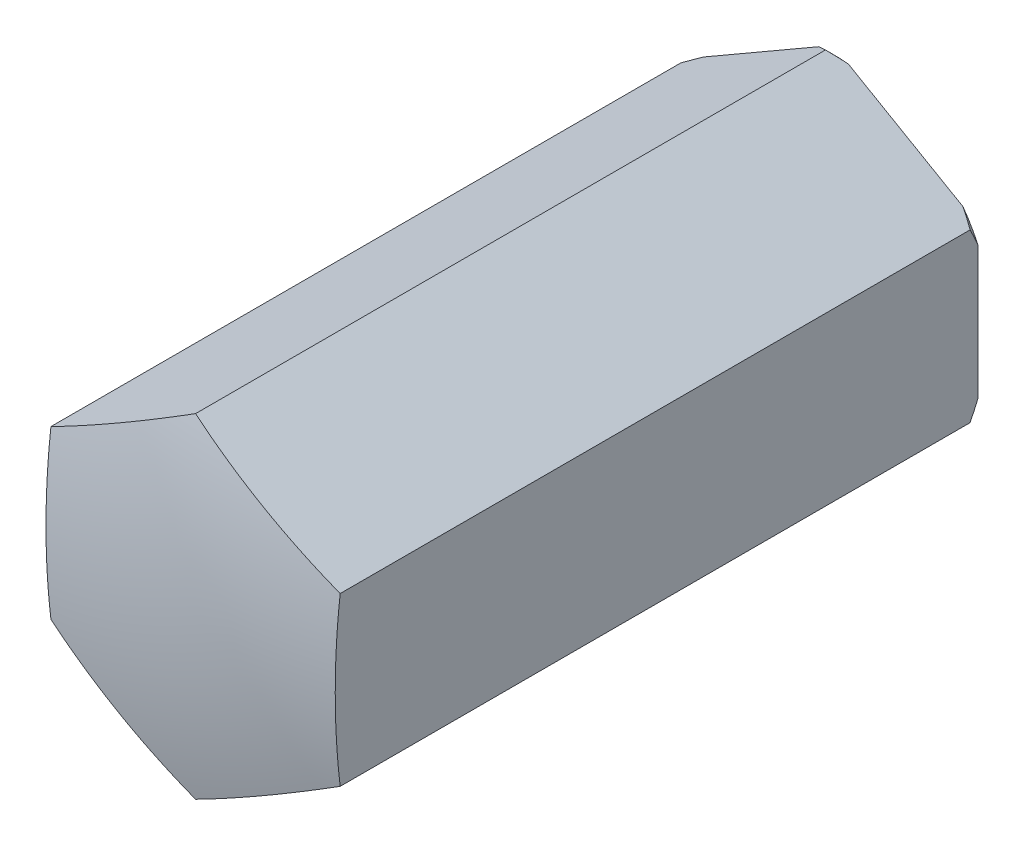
ISO-10303-21;
HEADER;
FILE_DESCRIPTION(('STEP AP214'),'2;1');
FILE_NAME('part.step','',(''),(''),'','','');
FILE_SCHEMA(('AUTOMOTIVE_DESIGN { 1 0 10303 214 1 1 1 1 }'));
ENDSEC;
DATA;
#1=APPLICATION_CONTEXT('core data for automotive mechanical design processes');
#2=APPLICATION_PROTOCOL_DEFINITION('international standard','automotive_design',2000,#1);
#3=PRODUCT_CONTEXT('',#1,'mechanical');
#4=PRODUCT('Part','Part','',(#3));
#5=PRODUCT_RELATED_PRODUCT_CATEGORY('part','',(#4));
#6=PRODUCT_DEFINITION_FORMATION('','',#4);
#7=PRODUCT_DEFINITION_CONTEXT('part definition',#1,'design');
#8=PRODUCT_DEFINITION('design','',#6,#7);
#9=PRODUCT_DEFINITION_SHAPE('','',#8);
#10=(LENGTH_UNIT() NAMED_UNIT(*) SI_UNIT(.MILLI.,.METRE.));
#11=(NAMED_UNIT(*) PLANE_ANGLE_UNIT() SI_UNIT($,.RADIAN.));
#12=(NAMED_UNIT(*) SI_UNIT($,.STERADIAN.) SOLID_ANGLE_UNIT());
#13=UNCERTAINTY_MEASURE_WITH_UNIT(LENGTH_MEASURE(1.E-05),#10,'distance_accuracy_value','');
#14=(GEOMETRIC_REPRESENTATION_CONTEXT(3) GLOBAL_UNCERTAINTY_ASSIGNED_CONTEXT((#13)) GLOBAL_UNIT_ASSIGNED_CONTEXT((#10,
#11,#12)) REPRESENTATION_CONTEXT('',''));
#15=CARTESIAN_POINT('',(0.,0.,0.));
#16=DIRECTION('',(0.,0.,1.));
#17=DIRECTION('',(1.,0.,0.));
#18=AXIS2_PLACEMENT_3D('',#15,#16,#17);
#19=CARTESIAN_POINT('',(0.,0.,0.));
#20=DIRECTION('',(0.,0.,1.));
#21=DIRECTION('',(0.,-1.,0.));
#22=AXIS2_PLACEMENT_3D('',#19,#20,#21);
#23=CONICAL_SURFACE('',#22,12.1,0.785398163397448);
#24=CARTESIAN_POINT('',(-9.86507388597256,7.00610285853,-0.00019999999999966));
#25=CARTESIAN_POINT('',(-9.96119990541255,6.95060447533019,0.0460383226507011));
#26=CARTESIAN_POINT('',(-10.0569364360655,6.89533096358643,0.0933496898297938));
#27=CARTESIAN_POINT('',(-10.2476169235,6.78524153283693,0.189970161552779));
#28=CARTESIAN_POINT('',(-10.3425611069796,6.73042548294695,0.239278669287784));
#29=CARTESIAN_POINT('',(-10.5316981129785,6.62122718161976,0.339771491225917));
#30=CARTESIAN_POINT('',(-10.6258909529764,6.56684492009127,0.390955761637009));
#31=CARTESIAN_POINT('',(-10.8135745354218,6.4584857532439,0.495094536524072));
#32=CARTESIAN_POINT('',(-10.9070650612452,6.40450897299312,0.548049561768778));
#33=CARTESIAN_POINT('',(-11.0002,6.35073749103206,0.601821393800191));
#34=B_SPLINE_CURVE_WITH_KNOTS('',3,(#24,#25,#26,#27,#28,#29,#30,#31,#32,#33),.UNSPECIFIED.,.F.,
.F.,(4,2,2,2,4),(0.,0.360718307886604,0.721329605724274,1.08193248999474,1.4426423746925),.UNSPECIFIED.);
#35=CARTESIAN_POINT('',(-9.86548966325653,7.00586280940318,0.));
#36=VERTEX_POINT('',#35);
#37=CARTESIAN_POINT('',(-11.,6.3508529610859,0.601705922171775));
#38=VERTEX_POINT('',#37);
#39=EDGE_CURVE('E223',#36,#38,#34,.T.);
#40=ORIENTED_EDGE('',*,*,#39,.F.);
#41=CARTESIAN_POINT('',(0.,0.,0.));
#42=DIRECTION('',(0.,0.,-1.));
#43=DIRECTION('',(0.,1.,0.));
#44=AXIS2_PLACEMENT_3D('',#41,#42,#43);
#45=CIRCLE('',#44,12.1);
#46=CARTESIAN_POINT('',(-11.,5.04083326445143,0.));
#47=VERTEX_POINT('',#46);
#48=EDGE_CURVE('E232',#47,#36,#45,.T.);
#49=ORIENTED_EDGE('',*,*,#48,.F.);
#50=CARTESIAN_POINT('',(-11.,16.0724477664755,7.37623108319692));
#51=CARTESIAN_POINT('',(-11.,15.8702057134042,7.2093371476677));
#52=CARTESIAN_POINT('',(-11.,15.6674737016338,7.04303709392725));
#53=CARTESIAN_POINT('',(-11.,15.2609313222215,6.71175492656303));
#54=CARTESIAN_POINT('',(-11.,15.0571209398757,6.54677283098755));
#55=CARTESIAN_POINT('',(-11.,14.4438351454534,6.05392702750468));
#56=CARTESIAN_POINT('',(-11.,14.0326017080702,5.72824373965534));
#57=CARTESIAN_POINT('',(-11.,13.1999564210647,5.08050106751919));
#58=CARTESIAN_POINT('',(-11.,12.7784823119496,4.75852150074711));
#59=CARTESIAN_POINT('',(-11.,11.9286566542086,4.12384110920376));
#60=CARTESIAN_POINT('',(-11.,11.5003057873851,3.81113937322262));
#61=CARTESIAN_POINT('',(-11.,10.5931500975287,3.16769731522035));
#62=CARTESIAN_POINT('',(-11.,10.1134868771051,2.83815635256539));
#63=CARTESIAN_POINT('',(-11.,9.38449294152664,2.35805816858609));
#64=CARTESIAN_POINT('',(-11.,9.13985858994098,2.20036220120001));
#65=CARTESIAN_POINT('',(-11.,8.64708986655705,1.89054685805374));
#66=CARTESIAN_POINT('',(-11.,8.39895566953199,1.73842720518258));
#67=CARTESIAN_POINT('',(-11.,7.89995903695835,1.441394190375));
#68=CARTESIAN_POINT('',(-11.,7.64911460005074,1.29645066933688));
#69=CARTESIAN_POINT('',(-11.,7.14316420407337,1.01414178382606));
#70=CARTESIAN_POINT('',(-11.,6.8880580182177,0.876776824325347));
#71=CARTESIAN_POINT('',(-11.,6.37340355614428,0.611087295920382));
#72=CARTESIAN_POINT('',(-11.,6.11385871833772,0.482756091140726));
#73=CARTESIAN_POINT('',(-11.,5.58983912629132,0.236644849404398));
#74=CARTESIAN_POINT('',(-11.,5.32536528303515,0.118862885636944));
#75=CARTESIAN_POINT('',(-11.,4.87055760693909,-0.0711489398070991));
#76=CARTESIAN_POINT('',(-11.,4.68153595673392,-0.146517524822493));
#77=CARTESIAN_POINT('',(-11.,4.30090682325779,-0.290396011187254));
#78=CARTESIAN_POINT('',(-11.,4.10929935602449,-0.35890595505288));
#79=CARTESIAN_POINT('',(-11.,3.53054922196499,-0.55302199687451));
#80=CARTESIAN_POINT('',(-11.,3.13947003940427,-0.667218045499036));
#81=CARTESIAN_POINT('',(-11.,2.3571577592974,-0.856520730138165));
#82=CARTESIAN_POINT('',(-11.,1.96613010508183,-0.932456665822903));
#83=CARTESIAN_POINT('',(-11.,1.3754168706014,-1.01606525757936));
#84=CARTESIAN_POINT('',(-11.,1.17780635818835,-1.03888598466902));
#85=CARTESIAN_POINT('',(-11.,0.781637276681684,-1.0740268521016));
#86=CARTESIAN_POINT('',(-11.,0.583078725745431,-1.0863471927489));
#87=CARTESIAN_POINT('',(-11.,0.196510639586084,-1.09984708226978));
#88=CARTESIAN_POINT('',(-11.,0.00852086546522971,-1.10160151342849));
#89=CARTESIAN_POINT('',(-11.,-0.367323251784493,-1.09547279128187));
#90=CARTESIAN_POINT('',(-11.,-0.555177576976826,-1.08758853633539));
#91=CARTESIAN_POINT('',(-11.,-0.930229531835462,-1.06232225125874));
#92=CARTESIAN_POINT('',(-11.,-1.11742721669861,-1.04494103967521));
#93=CARTESIAN_POINT('',(-11.,-1.49075054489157,-1.00099406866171));
#94=CARTESIAN_POINT('',(-11.,-1.67687603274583,-0.974427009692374));
#95=CARTESIAN_POINT('',(-11.,-2.24018324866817,-0.880381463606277));
#96=CARTESIAN_POINT('',(-11.,-2.61511811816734,-0.799063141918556));
#97=CARTESIAN_POINT('',(-11.,-3.35650285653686,-0.604878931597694));
#98=CARTESIAN_POINT('',(-11.,-3.72295280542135,-0.492013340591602));
#99=CARTESIAN_POINT('',(-11.,-4.4529629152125,-0.237887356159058));
#100=CARTESIAN_POINT('',(-11.,-4.81636046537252,-0.0961649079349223));
#101=CARTESIAN_POINT('',(-11.,-5.53386860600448,0.20927334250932));
#102=CARTESIAN_POINT('',(-11.,-5.88797506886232,0.372998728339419));
#103=CARTESIAN_POINT('',(-11.,-6.5885282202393,0.718563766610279));
#104=CARTESIAN_POINT('',(-11.,-6.93494780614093,0.900457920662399));
#105=CARTESIAN_POINT('',(-11.,-7.61987412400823,1.27837528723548));
#106=CARTESIAN_POINT('',(-11.,-7.95838202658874,1.47439639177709));
#107=CARTESIAN_POINT('',(-11.,-8.61194162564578,1.86785203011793));
#108=CARTESIAN_POINT('',(-11.,-8.92732558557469,2.06473756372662));
#109=CARTESIAN_POINT('',(-11.,-9.55267412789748,2.46695903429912));
#110=CARTESIAN_POINT('',(-11.,-9.86263830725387,2.67229559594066));
#111=CARTESIAN_POINT('',(-11.,-10.4753887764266,3.08826754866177));
#112=CARTESIAN_POINT('',(-11.,-10.7782124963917,3.29884800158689));
#113=CARTESIAN_POINT('',(-11.,-11.3796956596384,3.72570793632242));
#114=CARTESIAN_POINT('',(-11.,-11.6783562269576,3.94198583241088));
#115=CARTESIAN_POINT('',(-11.,-11.9752680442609,4.16059792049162));
#116=B_SPLINE_CURVE_WITH_KNOTS('',3,(#50,#51,#52,#53,#54,#55,#56,#57,#58,#59,#60,#61,#62,#63,
#64,#65,#66,#67,#68,#69,#70,#71,#72,#73,#74,#75,#76,#77,#78,#79,#80,#81,#82,#83,#84,#85,#86,#87,
#88,#89,#90,#91,#92,#93,#94,#95,#96,#97,#98,#99,#100,#101,#102,#103,#104,#105,#106,#107,#108,
#109,#110,#111,#112,#113,#114,#115),.UNSPECIFIED.,.F.,.F.,(4,2,2,2,2,2,2,2,2,2,2,2,2,2,2,2,2,2,
2,2,2,2,2,2,2,2,2,2,2,2,2,2,4),(0.,0.7866358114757,1.57328237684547,3.14695168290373,
4.73801099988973,6.32891353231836,8.0743905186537,8.94750152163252,9.82056907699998,
10.6895860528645,11.5586494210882,12.4270675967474,13.2953268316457,13.9056838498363,
14.5160370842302,15.7367149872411,16.9296541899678,17.5261883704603,18.1227111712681,
18.6864613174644,19.2502759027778,19.8140419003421,20.3778876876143,21.5270730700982,
22.6762476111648,23.845519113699,25.0153015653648,26.1887049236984,27.3619335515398,
28.4771587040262,29.5924664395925,30.698929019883,31.8050868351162),.UNSPECIFIED.);
#117=EDGE_CURVE('E216',#38,#47,#116,.T.);
#118=ORIENTED_EDGE('',*,*,#117,.F.);
#119=EDGE_LOOP('',(#40,#49,#118));
#120=FACE_BOUND('',#119,.T.);
#121=ADVANCED_FACE('F14',(#120),#23,.T.);
#122=CARTESIAN_POINT('',(-11.,-5.04083326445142,0.));
#123=VERTEX_POINT('',#122);
#124=CARTESIAN_POINT('',(-11.,-6.3508529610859,0.601705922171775));
#125=VERTEX_POINT('',#124);
#126=EDGE_CURVE('E209',#123,#125,#116,.T.);
#127=ORIENTED_EDGE('',*,*,#126,.F.);
#128=CARTESIAN_POINT('',(-9.86548966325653,-7.00586280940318,0.));
#129=VERTEX_POINT('',#128);
#130=EDGE_CURVE('E255',#129,#123,#45,.T.);
#131=ORIENTED_EDGE('',*,*,#130,.F.);
#132=CARTESIAN_POINT('',(-11.0002,-6.35073749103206,0.601821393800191));
#133=CARTESIAN_POINT('',(-10.9070650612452,-6.40450897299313,0.548049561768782));
#134=CARTESIAN_POINT('',(-10.8135745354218,-6.4584857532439,0.495094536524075));
#135=CARTESIAN_POINT('',(-10.6258909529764,-6.56684492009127,0.390955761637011));
#136=CARTESIAN_POINT('',(-10.5316981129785,-6.62122718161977,0.339771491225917));
#137=CARTESIAN_POINT('',(-10.3425611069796,-6.73042548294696,0.239278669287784));
#138=CARTESIAN_POINT('',(-10.2476169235,-6.78524153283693,0.189970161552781));
#139=CARTESIAN_POINT('',(-10.0569364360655,-6.89533096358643,0.0933496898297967));
#140=CARTESIAN_POINT('',(-9.96119990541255,-6.95060447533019,0.0460383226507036));
#141=CARTESIAN_POINT('',(-9.86507388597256,-7.00610285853,-0.000200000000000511));
#142=B_SPLINE_CURVE_WITH_KNOTS('',3,(#132,#133,#134,#135,#136,#137,#138,#139,#140,#141),
.UNSPECIFIED.,.F.,.F.,(4,2,2,2,4),(0.,0.360709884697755,0.721312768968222,1.08192406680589,
1.4426423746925),.UNSPECIFIED.);
#143=EDGE_CURVE('E185',#125,#129,#142,.T.);
#144=ORIENTED_EDGE('',*,*,#143,.F.);
#145=EDGE_LOOP('',(#127,#131,#144));
#146=FACE_BOUND('',#145,.T.);
#147=ADVANCED_FACE('F287',(#146),#23,.T.);
#148=CARTESIAN_POINT('',(-1.13492611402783,-12.0464560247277,-0.00019999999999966));
#149=CARTESIAN_POINT('',(-1.0388000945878,-12.1019544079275,0.0460383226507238));
#150=CARTESIAN_POINT('',(-0.94306356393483,-12.1572279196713,0.0933496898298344));
#151=CARTESIAN_POINT('',(-0.752383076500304,-12.2673173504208,0.189970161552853));
#152=CARTESIAN_POINT('',(-0.657438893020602,-12.3221334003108,0.239278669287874));
#153=CARTESIAN_POINT('',(-0.468301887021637,-12.431331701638,0.339771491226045));
#154=CARTESIAN_POINT('',(-0.374109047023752,-12.4857139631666,0.390955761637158));
#155=CARTESIAN_POINT('',(-0.186425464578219,-12.594073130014,0.495094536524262));
#156=CARTESIAN_POINT('',(-0.0929349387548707,-12.6480499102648,0.548049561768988));
#157=CARTESIAN_POINT('',(0.000199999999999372,-12.7018213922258,0.601821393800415));
#158=B_SPLINE_CURVE_WITH_KNOTS('',3,(#148,#149,#150,#151,#152,#153,#154,#155,#156,#157),
.UNSPECIFIED.,.F.,.F.,(4,2,2,2,4),(0.,0.360718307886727,0.721329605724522,1.08193248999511,
1.44264237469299),.UNSPECIFIED.);
#159=CARTESIAN_POINT('',(-1.13451033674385,-12.0466960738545,0.));
#160=VERTEX_POINT('',#159);
#161=CARTESIAN_POINT('',(0.,-12.701705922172,0.601705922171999));
#162=VERTEX_POINT('',#161);
#163=EDGE_CURVE('E191',#160,#162,#158,.T.);
#164=ORIENTED_EDGE('',*,*,#163,.F.);
#165=CARTESIAN_POINT('',(1.13451033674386,-12.0466960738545,0.));
#166=VERTEX_POINT('',#165);
#167=EDGE_CURVE('E256',#166,#160,#45,.T.);
#168=ORIENTED_EDGE('',*,*,#167,.F.);
#169=CARTESIAN_POINT('',(-0.000200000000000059,-12.7018213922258,0.601821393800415));
#170=CARTESIAN_POINT('',(0.0929349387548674,-12.6480499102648,0.548049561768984));
#171=CARTESIAN_POINT('',(0.186425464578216,-12.594073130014,0.495094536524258));
#172=CARTESIAN_POINT('',(0.374109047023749,-12.4857139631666,0.390955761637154));
#173=CARTESIAN_POINT('',(0.468301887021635,-12.431331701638,0.339771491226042));
#174=CARTESIAN_POINT('',(0.6574388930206,-12.3221334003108,0.239278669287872));
#175=CARTESIAN_POINT('',(0.752383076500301,-12.2673173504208,0.189970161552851));
#176=CARTESIAN_POINT('',(0.943063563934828,-12.1572279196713,0.0933496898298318));
#177=CARTESIAN_POINT('',(1.0388000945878,-12.1019544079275,0.0460383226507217));
#178=CARTESIAN_POINT('',(1.13492611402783,-12.0464560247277,-0.000199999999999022));
#179=B_SPLINE_CURVE_WITH_KNOTS('',3,(#169,#170,#171,#172,#173,#174,#175,#176,#177,#178),
.UNSPECIFIED.,.F.,.F.,(4,2,2,2,4),(0.,0.360709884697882,0.721312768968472,1.08192406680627,
1.44264237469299),.UNSPECIFIED.);
#180=EDGE_CURVE('E172',#162,#166,#179,.T.);
#181=ORIENTED_EDGE('',*,*,#180,.F.);
#182=EDGE_LOOP('',(#164,#168,#181));
#183=FACE_BOUND('',#182,.T.);
#184=ADVANCED_FACE('F280',(#183),#23,.T.);
#185=CARTESIAN_POINT('',(9.86507388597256,-7.00610285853,-0.00019999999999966));
#186=CARTESIAN_POINT('',(9.96119990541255,-6.95060447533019,0.0460383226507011));
#187=CARTESIAN_POINT('',(10.0569364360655,-6.89533096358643,0.0933496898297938));
#188=CARTESIAN_POINT('',(10.2476169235,-6.78524153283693,0.189970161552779));
#189=CARTESIAN_POINT('',(10.3425611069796,-6.73042548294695,0.239278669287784));
#190=CARTESIAN_POINT('',(10.5316981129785,-6.62122718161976,0.339771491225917));
#191=CARTESIAN_POINT('',(10.6258909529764,-6.56684492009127,0.390955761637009));
#192=CARTESIAN_POINT('',(10.8135745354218,-6.4584857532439,0.495094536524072));
#193=CARTESIAN_POINT('',(10.9070650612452,-6.40450897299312,0.548049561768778));
#194=CARTESIAN_POINT('',(11.0002,-6.35073749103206,0.601821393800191));
#195=B_SPLINE_CURVE_WITH_KNOTS('',3,(#185,#186,#187,#188,#189,#190,#191,#192,#193,#194),
.UNSPECIFIED.,.F.,.F.,(4,2,2,2,4),(0.,0.360718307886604,0.721329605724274,1.08193248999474,
1.4426423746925),.UNSPECIFIED.);
#196=CARTESIAN_POINT('',(9.86548966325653,-7.00586280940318,0.));
#197=VERTEX_POINT('',#196);
#198=CARTESIAN_POINT('',(11.,-6.3508529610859,0.601705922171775));
#199=VERTEX_POINT('',#198);
#200=EDGE_CURVE('E178',#197,#199,#195,.T.);
#201=ORIENTED_EDGE('',*,*,#200,.F.);
#202=CARTESIAN_POINT('',(11.,-5.04083326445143,0.));
#203=VERTEX_POINT('',#202);
#204=EDGE_CURVE('E260',#203,#197,#45,.T.);
#205=ORIENTED_EDGE('',*,*,#204,.F.);
#206=CARTESIAN_POINT('',(11.,16.0724477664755,7.37623108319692));
#207=CARTESIAN_POINT('',(11.,15.8702057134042,7.2093371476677));
#208=CARTESIAN_POINT('',(11.,15.6674737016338,7.04303709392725));
#209=CARTESIAN_POINT('',(11.,15.2609313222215,6.71175492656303));
#210=CARTESIAN_POINT('',(11.,15.0571209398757,6.54677283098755));
#211=CARTESIAN_POINT('',(11.,14.4438351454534,6.05392702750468));
#212=CARTESIAN_POINT('',(11.,14.0326017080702,5.72824373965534));
#213=CARTESIAN_POINT('',(11.,13.1999564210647,5.08050106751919));
#214=CARTESIAN_POINT('',(11.,12.7784823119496,4.75852150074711));
#215=CARTESIAN_POINT('',(11.,11.9286566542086,4.12384110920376));
#216=CARTESIAN_POINT('',(11.,11.5003057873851,3.81113937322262));
#217=CARTESIAN_POINT('',(11.,10.5931500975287,3.16769731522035));
#218=CARTESIAN_POINT('',(11.,10.1134868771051,2.83815635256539));
#219=CARTESIAN_POINT('',(11.,9.38449294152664,2.35805816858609));
#220=CARTESIAN_POINT('',(11.,9.13985858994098,2.20036220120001));
#221=CARTESIAN_POINT('',(11.,8.64708986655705,1.89054685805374));
#222=CARTESIAN_POINT('',(11.,8.39895566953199,1.73842720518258));
#223=CARTESIAN_POINT('',(11.,7.89995903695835,1.441394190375));
#224=CARTESIAN_POINT('',(11.,7.64911460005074,1.29645066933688));
#225=CARTESIAN_POINT('',(11.,7.14316420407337,1.01414178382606));
#226=CARTESIAN_POINT('',(11.,6.8880580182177,0.876776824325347));
#227=CARTESIAN_POINT('',(11.,6.37340355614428,0.611087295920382));
#228=CARTESIAN_POINT('',(11.,6.11385871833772,0.482756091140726));
#229=CARTESIAN_POINT('',(11.,5.58983912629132,0.236644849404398));
#230=CARTESIAN_POINT('',(11.,5.32536528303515,0.118862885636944));
#231=CARTESIAN_POINT('',(11.,4.87055760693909,-0.0711489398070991));
#232=CARTESIAN_POINT('',(11.,4.68153595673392,-0.146517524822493));
#233=CARTESIAN_POINT('',(11.,4.30090682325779,-0.290396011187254));
#234=CARTESIAN_POINT('',(11.,4.10929935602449,-0.35890595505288));
#235=CARTESIAN_POINT('',(11.,3.53054922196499,-0.55302199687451));
#236=CARTESIAN_POINT('',(11.,3.13947003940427,-0.667218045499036));
#237=CARTESIAN_POINT('',(11.,2.3571577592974,-0.856520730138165));
#238=CARTESIAN_POINT('',(11.,1.96613010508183,-0.932456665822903));
#239=CARTESIAN_POINT('',(11.,1.3754168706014,-1.01606525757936));
#240=CARTESIAN_POINT('',(11.,1.17780635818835,-1.03888598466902));
#241=CARTESIAN_POINT('',(11.,0.781637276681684,-1.0740268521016));
#242=CARTESIAN_POINT('',(11.,0.583078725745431,-1.0863471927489));
#243=CARTESIAN_POINT('',(11.,0.196510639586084,-1.09984708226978));
#244=CARTESIAN_POINT('',(11.,0.00852086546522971,-1.10160151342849));
#245=CARTESIAN_POINT('',(11.,-0.367323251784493,-1.09547279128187));
#246=CARTESIAN_POINT('',(11.,-0.555177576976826,-1.08758853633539));
#247=CARTESIAN_POINT('',(11.,-0.930229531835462,-1.06232225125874));
#248=CARTESIAN_POINT('',(11.,-1.11742721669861,-1.04494103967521));
#249=CARTESIAN_POINT('',(11.,-1.49075054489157,-1.00099406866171));
#250=CARTESIAN_POINT('',(11.,-1.67687603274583,-0.974427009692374));
#251=CARTESIAN_POINT('',(11.,-2.24018324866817,-0.880381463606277));
#252=CARTESIAN_POINT('',(11.,-2.61511811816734,-0.799063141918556));
#253=CARTESIAN_POINT('',(11.,-3.35650285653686,-0.604878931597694));
#254=CARTESIAN_POINT('',(11.,-3.72295280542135,-0.492013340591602));
#255=CARTESIAN_POINT('',(11.,-4.4529629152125,-0.237887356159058));
#256=CARTESIAN_POINT('',(11.,-4.81636046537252,-0.0961649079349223));
#257=CARTESIAN_POINT('',(11.,-5.53386860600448,0.20927334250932));
#258=CARTESIAN_POINT('',(11.,-5.88797506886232,0.372998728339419));
#259=CARTESIAN_POINT('',(11.,-6.5885282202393,0.718563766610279));
#260=CARTESIAN_POINT('',(11.,-6.93494780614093,0.900457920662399));
#261=CARTESIAN_POINT('',(11.,-7.61987412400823,1.27837528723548));
#262=CARTESIAN_POINT('',(11.,-7.95838202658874,1.47439639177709));
#263=CARTESIAN_POINT('',(11.,-8.61194162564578,1.86785203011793));
#264=CARTESIAN_POINT('',(11.,-8.92732558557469,2.06473756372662));
#265=CARTESIAN_POINT('',(11.,-9.55267412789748,2.46695903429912));
#266=CARTESIAN_POINT('',(11.,-9.86263830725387,2.67229559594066));
#267=CARTESIAN_POINT('',(11.,-10.4753887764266,3.08826754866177));
#268=CARTESIAN_POINT('',(11.,-10.7782124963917,3.29884800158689));
#269=CARTESIAN_POINT('',(11.,-11.3796956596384,3.72570793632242));
#270=CARTESIAN_POINT('',(11.,-11.6783562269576,3.94198583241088));
#271=CARTESIAN_POINT('',(11.,-11.9752680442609,4.16059792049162));
#272=B_SPLINE_CURVE_WITH_KNOTS('',3,(#206,#207,#208,#209,#210,#211,#212,#213,#214,#215,#216,
#217,#218,#219,#220,#221,#222,#223,#224,#225,#226,#227,#228,#229,#230,#231,#232,#233,#234,#235,
#236,#237,#238,#239,#240,#241,#242,#243,#244,#245,#246,#247,#248,#249,#250,#251,#252,#253,#254,
#255,#256,#257,#258,#259,#260,#261,#262,#263,#264,#265,#266,#267,#268,#269,#270,#271),
.UNSPECIFIED.,.F.,.F.,(4,2,2,2,2,2,2,2,2,2,2,2,2,2,2,2,2,2,2,2,2,2,2,2,2,2,2,2,2,2,2,2,4),(0.,
0.7866358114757,1.57328237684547,3.14695168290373,4.73801099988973,6.32891353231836,
8.0743905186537,8.94750152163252,9.82056907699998,10.6895860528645,11.5586494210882,
12.4270675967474,13.2953268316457,13.9056838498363,14.5160370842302,15.7367149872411,
16.9296541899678,17.5261883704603,18.1227111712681,18.6864613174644,19.2502759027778,
19.8140419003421,20.3778876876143,21.5270730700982,22.6762476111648,23.845519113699,
25.0153015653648,26.1887049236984,27.3619335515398,28.4771587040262,29.5924664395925,
30.698929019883,31.8050868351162),.UNSPECIFIED.);
#273=EDGE_CURVE('E171',#199,#203,#272,.F.);
#274=ORIENTED_EDGE('',*,*,#273,.F.);
#275=EDGE_LOOP('',(#201,#205,#274));
#276=FACE_BOUND('',#275,.T.);
#277=ADVANCED_FACE('F274',(#276),#23,.T.);
#278=CARTESIAN_POINT('',(0.000200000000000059,12.7018213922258,0.601821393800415));
#279=CARTESIAN_POINT('',(-0.0929349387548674,12.6480499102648,0.548049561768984));
#280=CARTESIAN_POINT('',(-0.186425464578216,12.594073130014,0.495094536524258));
#281=CARTESIAN_POINT('',(-0.374109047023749,12.4857139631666,0.390955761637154));
#282=CARTESIAN_POINT('',(-0.468301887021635,12.431331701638,0.339771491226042));
#283=CARTESIAN_POINT('',(-0.6574388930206,12.3221334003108,0.239278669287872));
#284=CARTESIAN_POINT('',(-0.752383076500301,12.2673173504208,0.189970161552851));
#285=CARTESIAN_POINT('',(-0.943063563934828,12.1572279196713,0.0933496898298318));
#286=CARTESIAN_POINT('',(-1.0388000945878,12.1019544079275,0.0460383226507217));
#287=CARTESIAN_POINT('',(-1.13492611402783,12.0464560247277,-0.000199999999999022));
#288=B_SPLINE_CURVE_WITH_KNOTS('',3,(#278,#279,#280,#281,#282,#283,#284,#285,#286,#287),
.UNSPECIFIED.,.F.,.F.,(4,2,2,2,4),(0.,0.360709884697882,0.721312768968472,1.08192406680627,
1.44264237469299),.UNSPECIFIED.);
#289=CARTESIAN_POINT('',(0.,12.701705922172,0.601705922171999));
#290=VERTEX_POINT('',#289);
#291=CARTESIAN_POINT('',(-1.13451033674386,12.0466960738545,0.));
#292=VERTEX_POINT('',#291);
#293=EDGE_CURVE('E217',#290,#292,#288,.T.);
#294=ORIENTED_EDGE('',*,*,#293,.F.);
#295=CARTESIAN_POINT('',(1.13492611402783,12.0464560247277,-0.00019999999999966));
#296=CARTESIAN_POINT('',(1.0388000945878,12.1019544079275,0.0460383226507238));
#297=CARTESIAN_POINT('',(0.94306356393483,12.1572279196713,0.0933496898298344));
#298=CARTESIAN_POINT('',(0.752383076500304,12.2673173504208,0.189970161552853));
#299=CARTESIAN_POINT('',(0.657438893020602,12.3221334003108,0.239278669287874));
#300=CARTESIAN_POINT('',(0.468301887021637,12.431331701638,0.339771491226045));
#301=CARTESIAN_POINT('',(0.374109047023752,12.4857139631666,0.390955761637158));
#302=CARTESIAN_POINT('',(0.186425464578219,12.594073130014,0.495094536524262));
#303=CARTESIAN_POINT('',(0.0929349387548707,12.6480499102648,0.548049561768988));
#304=CARTESIAN_POINT('',(-0.000199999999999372,12.7018213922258,0.601821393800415));
#305=B_SPLINE_CURVE_WITH_KNOTS('',3,(#295,#296,#297,#298,#299,#300,#301,#302,#303,#304),
.UNSPECIFIED.,.F.,.F.,(4,2,2,2,4),(0.,0.360718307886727,0.721329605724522,1.08193248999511,
1.44264237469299),.UNSPECIFIED.);
#306=CARTESIAN_POINT('',(1.13451033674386,12.0466960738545,0.));
#307=VERTEX_POINT('',#306);
#308=EDGE_CURVE('E121',#307,#290,#305,.T.);
#309=ORIENTED_EDGE('',*,*,#308,.F.);
#310=EDGE_CURVE('E229',#292,#307,#45,.T.);
#311=ORIENTED_EDGE('',*,*,#310,.F.);
#312=EDGE_LOOP('',(#294,#309,#311));
#313=FACE_BOUND('',#312,.T.);
#314=ADVANCED_FACE('F304',(#313),#23,.T.);
#315=CARTESIAN_POINT('',(11.,5.04083326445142,0.));
#316=VERTEX_POINT('',#315);
#317=CARTESIAN_POINT('',(11.,6.3508529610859,0.601705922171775));
#318=VERTEX_POINT('',#317);
#319=EDGE_CURVE('E164',#316,#318,#272,.F.);
#320=ORIENTED_EDGE('',*,*,#319,.F.);
#321=CARTESIAN_POINT('',(9.86548966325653,7.00586280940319,0.));
#322=VERTEX_POINT('',#321);
#323=EDGE_CURVE('E233',#322,#316,#45,.T.);
#324=ORIENTED_EDGE('',*,*,#323,.F.);
#325=CARTESIAN_POINT('',(11.0002,6.35073749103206,0.601821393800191));
#326=CARTESIAN_POINT('',(10.9070650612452,6.40450897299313,0.548049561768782));
#327=CARTESIAN_POINT('',(10.8135745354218,6.4584857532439,0.495094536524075));
#328=CARTESIAN_POINT('',(10.6258909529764,6.56684492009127,0.390955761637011));
#329=CARTESIAN_POINT('',(10.5316981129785,6.62122718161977,0.339771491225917));
#330=CARTESIAN_POINT('',(10.3425611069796,6.73042548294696,0.239278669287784));
#331=CARTESIAN_POINT('',(10.2476169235,6.78524153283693,0.189970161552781));
#332=CARTESIAN_POINT('',(10.0569364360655,6.89533096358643,0.0933496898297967));
#333=CARTESIAN_POINT('',(9.96119990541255,6.95060447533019,0.0460383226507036));
#334=CARTESIAN_POINT('',(9.86507388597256,7.00610285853,-0.000200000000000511));
#335=B_SPLINE_CURVE_WITH_KNOTS('',3,(#325,#326,#327,#328,#329,#330,#331,#332,#333,#334),
.UNSPECIFIED.,.F.,.F.,(4,2,2,2,4),(0.,0.360709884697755,0.721312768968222,1.08192406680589,
1.4426423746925),.UNSPECIFIED.);
#336=EDGE_CURVE('E37',#318,#322,#335,.T.);
#337=ORIENTED_EDGE('',*,*,#336,.F.);
#338=EDGE_LOOP('',(#320,#324,#337));
#339=FACE_BOUND('',#338,.T.);
#340=ADVANCED_FACE('F16',(#339),#23,.T.);
#341=CARTESIAN_POINT('',(12.1,0.,0.));
#342=DIRECTION('',(0.,0.,-1.));
#343=DIRECTION('',(0.,1.,0.));
#344=AXIS2_PLACEMENT_3D('',#341,#342,#343);
#345=PLANE('',#344);
#346=DIRECTION('',(-0.866025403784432,-0.500000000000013,0.));
#347=VECTOR('',#346,1.);
#348=CARTESIAN_POINT('',(3.57499999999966,14.7657331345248,0.));
#349=LINE('',#348,#347);
#350=EDGE_CURVE('E23',#292,#36,#349,.T.);
#351=ORIENTED_EDGE('',*,*,#350,.F.);
#352=ORIENTED_EDGE('',*,*,#310,.T.);
#353=DIRECTION('',(-0.866025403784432,0.500000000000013,0.));
#354=VECTOR('',#353,1.);
#355=CARTESIAN_POINT('',(14.575,4.28682574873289,0.));
#356=LINE('',#355,#354);
#357=EDGE_CURVE('E234',#322,#307,#356,.T.);
#358=ORIENTED_EDGE('',*,*,#357,.F.);
#359=ORIENTED_EDGE('',*,*,#323,.T.);
#360=DIRECTION('',(0.,1.,0.));
#361=VECTOR('',#360,1.);
#362=CARTESIAN_POINT('',(11.,0.,0.));
#363=LINE('',#362,#361);
#364=EDGE_CURVE('E236',#203,#316,#363,.T.);
#365=ORIENTED_EDGE('',*,*,#364,.F.);
#366=ORIENTED_EDGE('',*,*,#204,.T.);
#367=DIRECTION('',(0.866025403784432,0.500000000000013,0.));
#368=VECTOR('',#367,1.);
#369=CARTESIAN_POINT('',(14.575,-4.28682574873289,0.));
#370=LINE('',#369,#368);
#371=EDGE_CURVE('E238',#166,#197,#370,.T.);
#372=ORIENTED_EDGE('',*,*,#371,.F.);
#373=ORIENTED_EDGE('',*,*,#167,.T.);
#374=DIRECTION('',(0.866025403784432,-0.500000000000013,0.));
#375=VECTOR('',#374,1.);
#376=CARTESIAN_POINT('',(3.57499999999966,-14.7657331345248,0.));
#377=LINE('',#376,#375);
#378=EDGE_CURVE('E240',#129,#160,#377,.T.);
#379=ORIENTED_EDGE('',*,*,#378,.F.);
#380=ORIENTED_EDGE('',*,*,#130,.T.);
#381=DIRECTION('',(0.,-1.,0.));
#382=VECTOR('',#381,1.);
#383=CARTESIAN_POINT('',(-11.,0.,0.));
#384=LINE('',#383,#382);
#385=EDGE_CURVE('E242',#47,#123,#384,.T.);
#386=ORIENTED_EDGE('',*,*,#385,.F.);
#387=ORIENTED_EDGE('',*,*,#48,.T.);
#388=EDGE_LOOP('',(#351,#352,#358,#359,#365,#366,#372,#373,#379,#380,#386,#387));
#389=FACE_BOUND('',#388,.T.);
#390=CARTESIAN_POINT('',(0.,0.,0.));
#391=DIRECTION('',(0.,0.,-1.));
#392=DIRECTION('',(-1.,0.,0.));
#393=AXIS2_PLACEMENT_3D('',#390,#391,#392);
#394=CIRCLE('',#393,6.);
#395=CARTESIAN_POINT('',(-6.,0.,0.));
#396=VERTEX_POINT('',#395);
#397=EDGE_CURVE('E116',#396,#396,#394,.T.);
#398=ORIENTED_EDGE('',*,*,#397,.F.);
#399=EDGE_LOOP('',(#398));
#400=FACE_BOUND('',#399,.T.);
#401=ADVANCED_FACE('F252',(#389,#400),#345,.T.);
#402=CARTESIAN_POINT('',(0.,12.701705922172,51.));
#403=DIRECTION('',(0.500000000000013,-0.866025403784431,0.));
#404=DIRECTION('',(0.866025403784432,0.500000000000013,0.));
#405=AXIS2_PLACEMENT_3D('',#402,#403,#404);
#406=PLANE('',#405);
#407=DIRECTION('',(0.,0.,-1.));
#408=VECTOR('',#407,1.);
#409=CARTESIAN_POINT('',(-11.,6.3508529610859,51.));
#410=LINE('',#409,#408);
#411=CARTESIAN_POINT('',(-11.,6.3508529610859,48.5132382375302));
#412=VERTEX_POINT('',#411);
#413=EDGE_CURVE('E115',#412,#38,#410,.T.);
#414=ORIENTED_EDGE('',*,*,#413,.F.);
#415=CARTESIAN_POINT('',(-5.5000000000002,9.52627944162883,-5.));
#416=DIRECTION('',(0.500000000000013,-0.866025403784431,0.));
#417=DIRECTION('',(0.866025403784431,0.500000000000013,0.));
#418=AXIS2_PLACEMENT_3D('',#415,#416,#417);
#419=CIRCLE('',#418,53.8887743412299);
#420=CARTESIAN_POINT('',(0.,12.701705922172,48.5132382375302));
#421=VERTEX_POINT('',#420);
#422=EDGE_CURVE('E105',#412,#421,#419,.F.);
#423=ORIENTED_EDGE('',*,*,#422,.T.);
#424=DIRECTION('',(0.,0.,-1.));
#425=VECTOR('',#424,1.);
#426=CARTESIAN_POINT('',(0.,12.701705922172,51.));
#427=LINE('',#426,#425);
#428=EDGE_CURVE('E112',#421,#290,#427,.T.);
#429=ORIENTED_EDGE('',*,*,#428,.T.);
#430=ORIENTED_EDGE('',*,*,#293,.T.);
#431=ORIENTED_EDGE('',*,*,#350,.T.);
#432=ORIENTED_EDGE('',*,*,#39,.T.);
#433=EDGE_LOOP('',(#414,#423,#429,#430,#431,#432));
#434=FACE_BOUND('',#433,.T.);
#435=ADVANCED_FACE('F111',(#434),#406,.F.);
#436=CARTESIAN_POINT('',(-11.,6.3508529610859,51.));
#437=DIRECTION('',(1.,0.,0.));
#438=DIRECTION('',(0.,1.,0.));
#439=AXIS2_PLACEMENT_3D('',#436,#437,#438);
#440=PLANE('',#439);
#441=DIRECTION('',(0.,0.,-1.));
#442=VECTOR('',#441,1.);
#443=CARTESIAN_POINT('',(-11.,-6.3508529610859,51.));
#444=LINE('',#443,#442);
#445=CARTESIAN_POINT('',(-11.,-6.3508529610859,48.5132382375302));
#446=VERTEX_POINT('',#445);
#447=EDGE_CURVE('E135',#446,#125,#444,.T.);
#448=ORIENTED_EDGE('',*,*,#447,.F.);
#449=CARTESIAN_POINT('',(-11.,0.,-5.));
#450=DIRECTION('',(1.,0.,0.));
#451=DIRECTION('',(0.,0.,-1.));
#452=AXIS2_PLACEMENT_3D('',#449,#450,#451);
#453=CIRCLE('',#452,53.8887743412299);
#454=EDGE_CURVE('E117',#446,#412,#453,.F.);
#455=ORIENTED_EDGE('',*,*,#454,.T.);
#456=ORIENTED_EDGE('',*,*,#413,.T.);
#457=ORIENTED_EDGE('',*,*,#117,.T.);
#458=ORIENTED_EDGE('',*,*,#385,.T.);
#459=ORIENTED_EDGE('',*,*,#126,.T.);
#460=EDGE_LOOP('',(#448,#455,#456,#457,#458,#459));
#461=FACE_BOUND('',#460,.T.);
#462=ADVANCED_FACE('F201',(#461),#440,.F.);
#463=CARTESIAN_POINT('',(-11.,-6.3508529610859,51.));
#464=DIRECTION('',(0.500000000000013,0.866025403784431,0.));
#465=DIRECTION('',(-0.866025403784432,0.500000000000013,0.));
#466=AXIS2_PLACEMENT_3D('',#463,#464,#465);
#467=PLANE('',#466);
#468=DIRECTION('',(0.,0.,-1.));
#469=VECTOR('',#468,1.);
#470=CARTESIAN_POINT('',(0.,-12.701705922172,51.));
#471=LINE('',#470,#469);
#472=CARTESIAN_POINT('',(0.,-12.701705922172,48.5132382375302));
#473=VERTEX_POINT('',#472);
#474=EDGE_CURVE('E133',#473,#162,#471,.T.);
#475=ORIENTED_EDGE('',*,*,#474,.F.);
#476=CARTESIAN_POINT('',(-5.5000000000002,-9.52627944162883,-5.));
#477=DIRECTION('',(0.500000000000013,0.866025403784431,0.));
#478=DIRECTION('',(-0.866025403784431,0.500000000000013,0.));
#479=AXIS2_PLACEMENT_3D('',#476,#477,#478);
#480=CIRCLE('',#479,53.8887743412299);
#481=EDGE_CURVE('E289',#473,#446,#480,.F.);
#482=ORIENTED_EDGE('',*,*,#481,.T.);
#483=ORIENTED_EDGE('',*,*,#447,.T.);
#484=ORIENTED_EDGE('',*,*,#143,.T.);
#485=ORIENTED_EDGE('',*,*,#378,.T.);
#486=ORIENTED_EDGE('',*,*,#163,.T.);
#487=EDGE_LOOP('',(#475,#482,#483,#484,#485,#486));
#488=FACE_BOUND('',#487,.T.);
#489=ADVANCED_FACE('F197',(#488),#467,.F.);
#490=CARTESIAN_POINT('',(0.,-12.701705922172,51.));
#491=DIRECTION('',(-0.500000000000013,0.866025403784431,0.));
#492=DIRECTION('',(-0.866025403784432,-0.500000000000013,0.));
#493=AXIS2_PLACEMENT_3D('',#490,#491,#492);
#494=PLANE('',#493);
#495=DIRECTION('',(0.,0.,-1.));
#496=VECTOR('',#495,1.);
#497=CARTESIAN_POINT('',(11.,-6.3508529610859,51.));
#498=LINE('',#497,#496);
#499=CARTESIAN_POINT('',(11.,-6.3508529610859,48.5132382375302));
#500=VERTEX_POINT('',#499);
#501=EDGE_CURVE('E126',#500,#199,#498,.T.);
#502=ORIENTED_EDGE('',*,*,#501,.F.);
#503=CARTESIAN_POINT('',(5.50000000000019,-9.52627944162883,-5.));
#504=DIRECTION('',(-0.500000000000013,0.866025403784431,0.));
#505=DIRECTION('',(-0.866025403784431,-0.500000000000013,0.));
#506=AXIS2_PLACEMENT_3D('',#503,#504,#505);
#507=CIRCLE('',#506,53.8887743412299);
#508=EDGE_CURVE('E291',#500,#473,#507,.F.);
#509=ORIENTED_EDGE('',*,*,#508,.T.);
#510=ORIENTED_EDGE('',*,*,#474,.T.);
#511=ORIENTED_EDGE('',*,*,#180,.T.);
#512=ORIENTED_EDGE('',*,*,#371,.T.);
#513=ORIENTED_EDGE('',*,*,#200,.T.);
#514=EDGE_LOOP('',(#502,#509,#510,#511,#512,#513));
#515=FACE_BOUND('',#514,.T.);
#516=ADVANCED_FACE('F160',(#515),#494,.F.);
#517=CARTESIAN_POINT('',(11.,-6.3508529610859,51.));
#518=DIRECTION('',(-1.,0.,0.));
#519=DIRECTION('',(0.,-1.,0.));
#520=AXIS2_PLACEMENT_3D('',#517,#518,#519);
#521=PLANE('',#520);
#522=DIRECTION('',(0.,0.,-1.));
#523=VECTOR('',#522,1.);
#524=CARTESIAN_POINT('',(11.,6.3508529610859,51.));
#525=LINE('',#524,#523);
#526=CARTESIAN_POINT('',(11.,6.3508529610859,48.5132382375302));
#527=VERTEX_POINT('',#526);
#528=EDGE_CURVE('E123',#527,#318,#525,.T.);
#529=ORIENTED_EDGE('',*,*,#528,.F.);
#530=CARTESIAN_POINT('',(11.,0.,-5.));
#531=DIRECTION('',(-1.,0.,0.));
#532=DIRECTION('',(0.,0.,1.));
#533=AXIS2_PLACEMENT_3D('',#530,#531,#532);
#534=CIRCLE('',#533,53.8887743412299);
#535=EDGE_CURVE('E30',#527,#500,#534,.F.);
#536=ORIENTED_EDGE('',*,*,#535,.T.);
#537=ORIENTED_EDGE('',*,*,#501,.T.);
#538=ORIENTED_EDGE('',*,*,#273,.T.);
#539=ORIENTED_EDGE('',*,*,#364,.T.);
#540=ORIENTED_EDGE('',*,*,#319,.T.);
#541=EDGE_LOOP('',(#529,#536,#537,#538,#539,#540));
#542=FACE_BOUND('',#541,.T.);
#543=ADVANCED_FACE('F154',(#542),#521,.F.);
#544=CARTESIAN_POINT('',(11.,6.3508529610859,51.));
#545=DIRECTION('',(-0.500000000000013,-0.866025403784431,0.));
#546=DIRECTION('',(0.866025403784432,-0.500000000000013,0.));
#547=AXIS2_PLACEMENT_3D('',#544,#545,#546);
#548=PLANE('',#547);
#549=ORIENTED_EDGE('',*,*,#428,.F.);
#550=CARTESIAN_POINT('',(5.5000000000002,9.52627944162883,-5.));
#551=DIRECTION('',(-0.500000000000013,-0.866025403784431,0.));
#552=DIRECTION('',(0.866025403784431,-0.500000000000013,0.));
#553=AXIS2_PLACEMENT_3D('',#550,#551,#552);
#554=CIRCLE('',#553,53.8887743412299);
#555=EDGE_CURVE('E9',#421,#527,#554,.F.);
#556=ORIENTED_EDGE('',*,*,#555,.T.);
#557=ORIENTED_EDGE('',*,*,#528,.T.);
#558=ORIENTED_EDGE('',*,*,#336,.T.);
#559=ORIENTED_EDGE('',*,*,#357,.T.);
#560=ORIENTED_EDGE('',*,*,#308,.T.);
#561=EDGE_LOOP('',(#549,#556,#557,#558,#559,#560));
#562=FACE_BOUND('',#561,.T.);
#563=ADVANCED_FACE('F119',(#562),#548,.F.);
#564=CARTESIAN_POINT('',(0.,0.,25.));
#565=DIRECTION('',(0.,0.,-1.));
#566=DIRECTION('',(-1.,0.,0.));
#567=AXIS2_PLACEMENT_3D('',#564,#565,#566);
#568=CYLINDRICAL_SURFACE('',#567,6.);
#569=CARTESIAN_POINT('',(0.,0.,25.));
#570=DIRECTION('',(0.,0.,-1.));
#571=DIRECTION('',(-1.,0.,0.));
#572=AXIS2_PLACEMENT_3D('',#569,#570,#571);
#573=CIRCLE('',#572,6.);
#574=CARTESIAN_POINT('',(-6.,0.,25.));
#575=VERTEX_POINT('',#574);
#576=EDGE_CURVE('E124',#575,#575,#573,.T.);
#577=ORIENTED_EDGE('',*,*,#576,.F.);
#578=EDGE_LOOP('',(#577));
#579=FACE_BOUND('',#578,.T.);
#580=ORIENTED_EDGE('',*,*,#397,.T.);
#581=EDGE_LOOP('',(#580));
#582=FACE_BOUND('',#581,.T.);
#583=ADVANCED_FACE('F153',(#579,#582),#568,.F.);
#584=CARTESIAN_POINT('',(0.,0.,25.));
#585=DIRECTION('',(0.,0.,-1.));
#586=DIRECTION('',(-1.,0.,0.));
#587=AXIS2_PLACEMENT_3D('',#584,#585,#586);
#588=PLANE('',#587);
#589=ORIENTED_EDGE('',*,*,#576,.T.);
#590=EDGE_LOOP('',(#589));
#591=FACE_BOUND('',#590,.T.);
#592=ADVANCED_FACE('F360',(#591),#588,.T.);
#593=CARTESIAN_POINT('',(0.,0.,-5.));
#594=DIRECTION('',(0.,0.,-1.));
#595=DIRECTION('',(0.,1.,0.));
#596=AXIS2_PLACEMENT_3D('',#593,#594,#595);
#597=SPHERICAL_SURFACE('',#596,55.);
#598=CARTESIAN_POINT('',(0.,0.,50.));
#599=VERTEX_POINT('',#598);
#600=VERTEX_LOOP('',#599);
#601=FACE_BOUND('',#600,.T.);
#602=ORIENTED_EDGE('',*,*,#454,.F.);
#603=ORIENTED_EDGE('',*,*,#481,.F.);
#604=ORIENTED_EDGE('',*,*,#508,.F.);
#605=ORIENTED_EDGE('',*,*,#535,.F.);
#606=ORIENTED_EDGE('',*,*,#555,.F.);
#607=ORIENTED_EDGE('',*,*,#422,.F.);
#608=EDGE_LOOP('',(#602,#603,#604,#605,#606,#607));
#609=FACE_BOUND('',#608,.T.);
#610=ADVANCED_FACE('F104',(#601,#609),#597,.T.);
#611=CLOSED_SHELL('',(#121,#147,#184,#277,#314,#340,#401,#435,#462,#489,#516,#543,#563,#583,
#592,#610));
#612=MANIFOLD_SOLID_BREP('B1',#611);
#613=ADVANCED_BREP_SHAPE_REPRESENTATION('',(#18,#612),#14);
#614=SHAPE_DEFINITION_REPRESENTATION(#9,#613);
ENDSEC;
END-ISO-10303-21;
